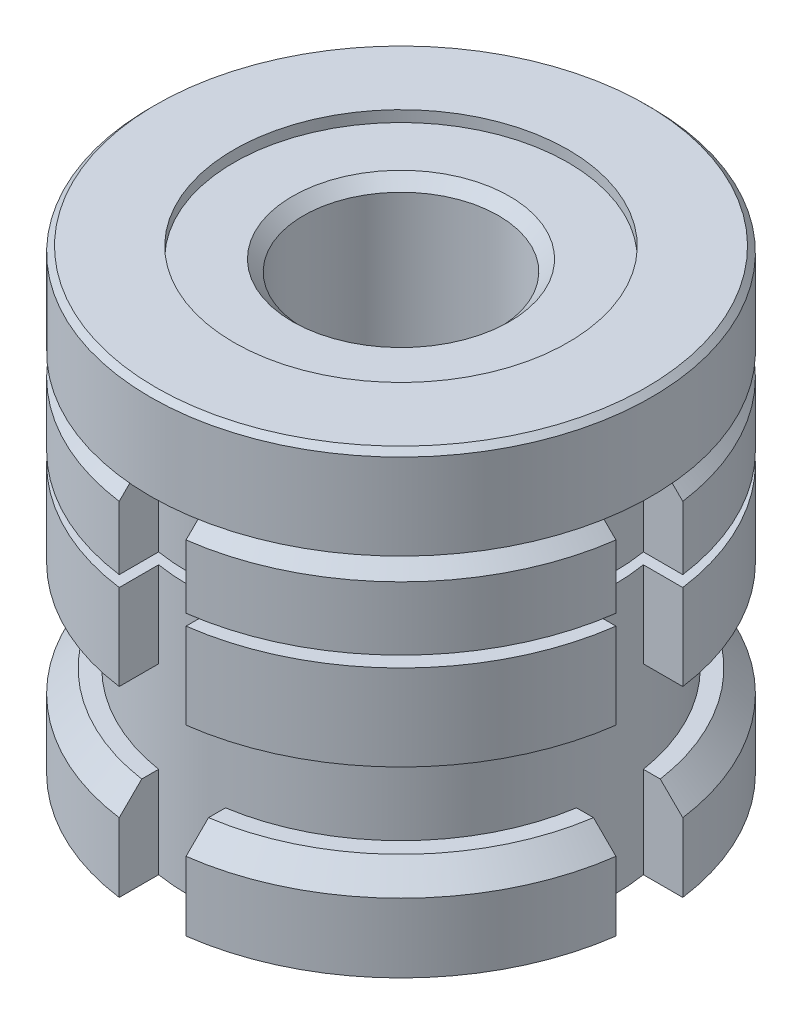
from build123d import *
from build123d.topology import SkipClean

# Parameters (mm, degrees)
SKETCH1_R           = 22.5
BOSS_EXTRUDE1_DEPTH = 16.4
SKETCH2_W           = 7.5
SKETCH2_H           = 1
SKETCH3_R           = 19
BOSS_EXTRUDE2_DEPTH = 16.4
SKETCH4_R           = 22.5
BOSS_EXTRUDE3_DEPTH = 8.2
CUT_EXTRUDE4_START  = -32.8
CUT_EXTRUDE4_DEPTH  = 32.8
CHAMFER1_SIZE       = 2
SKETCH6_R           = 22.5
BOSS_EXTRUDE4_DEPTH = 8.2
CHAMFER2_SIZE       = 0.5
CUT_EXTRUDE5_START  = -1
SKETCH7_R           = 15
CUT_EXTRUDE5_DEPTH  = 1
SKETCH8_R           = 8.75
CUT_EXTRUDE6_DEPTH  = 40
CHAMFER3_SIZE       = 1


with BuildPart() as part:
    # Sketch1 → Boss-Extrude1 (new body)
    with BuildSketch(Plane(origin=(0, 0, 0), x_dir=(1, 0, 0), z_dir=(0, 1, 0))):
        with Locations(Location((0, 0, 0), (0, 0, 270))):
            Circle(SKETCH1_R)
    extrude(amount=BOSS_EXTRUDE1_DEPTH)

    # Sketch2 → Cut-Revolve1 (revolve, cut)
    with BuildSketch(Plane(origin=(0, 0, 0), x_dir=(0, 0, -1), z_dir=(1, 0, 0))):
        with Locations((-18.75, 8.2)):
            Rectangle(SKETCH2_W, SKETCH2_H)
    revolve(axis=Axis((0, 13.26477, 0), (0, -1, 0)), mode=Mode.SUBTRACT)

    # Sketch3 → Boss-Extrude2 (add)
    with BuildSketch(Plane.XZ):
        with Locations(Location((0, 0, 0), (0, 0, 270))):
            Circle(SKETCH3_R)
    extrude(amount=BOSS_EXTRUDE2_DEPTH)

    # Sketch4 → Boss-Extrude3 (add)
    with BuildSketch(Plane.XZ.offset(16.4)):
        with Locations(Location((0, 0, 0), (0, 0, 90))):
            Circle(SKETCH4_R)
    extrude(amount=-BOSS_EXTRUDE3_DEPTH)

    # Sketch5 → Cut-Extrude4 (cut)
    with SkipClean():  # the faces are left unmerged after this step: merging them gives an invalid solid
        with BuildSketch(Plane(origin=(0, 16.4, 0), x_dir=(1, 0, 0), z_dir=(0, 1, 0)).offset(CUT_EXTRUDE4_START)):
            with BuildLine():
                Line((-22.299103, 3), (-18.761663, 3))
                ThreePointArc((-18.761663, 3), (-19, 0), (-18.761663, -3))
                Line((-18.761663, -3), (-22.299103, -3))
                ThreePointArc((-22.299103, -3), (-22.5, 0), (-22.299103, 3))
            make_face()
            with BuildLine():
                Line((-3, 22.299103), (-3, 18.761663))
                ThreePointArc((-3, 18.761663), (0, 19), (3, 18.761663))
                Line((3, 18.761663), (3, 22.299103))
                ThreePointArc((3, 22.299103), (0, 22.5), (-3, 22.299103))
            make_face()
            with BuildLine():
                Line((18.761663, 3), (22.299103, 3))
                ThreePointArc((22.299103, 3), (22.5, 0), (22.299103, -3))
                Line((22.299103, -3), (18.761663, -3))
                ThreePointArc((18.761663, -3), (19, 0), (18.761663, 3))
            make_face()
            with BuildLine():
                Line((-3, -18.761663), (-3, -22.299103))
                ThreePointArc((-3, -22.299103), (0, -22.5), (3, -22.299103))
                Line((3, -22.299103), (3, -18.761663))
                ThreePointArc((3, -18.761663), (0, -19), (-3, -18.761663))
            make_face()
        extrude(amount=CUT_EXTRUDE4_DEPTH, mode=Mode.SUBTRACT)

    # Chamfer1
    chamfer1_edges = [part.edges().sort_by_distance(p)[0] for p in [
        (15.909903, -8.2, -15.909903),
        (15.909903, -8.2, 15.909903),
        (-15.909903, -8.2, 15.909903),
        (-15.909903, -8.2, -15.909903),
        (15.909903, 16.4, 15.909903),
        (15.909903, 16.4, -15.909903),
        (-15.909903, 16.4, -15.909903),
        (-15.909903, 16.4, 15.909903),
    ]]
    chamfer(chamfer1_edges, length=CHAMFER1_SIZE)

    # Sketch6 → Boss-Extrude4 (add)
    with BuildSketch(Plane(origin=(0, 16.4, 0), x_dir=(1, 0, 0), z_dir=(0, 1, 0))):
        with Locations(Location((0, 0, 0), (0, 0, 270))):
            Circle(SKETCH6_R)
    extrude(amount=BOSS_EXTRUDE4_DEPTH)

    # Chamfer2
    chamfer2_edges = [part.edges().sort_by_distance(p)[0] for p in [
        (0, 24.6, -22.5),
    ]]
    chamfer(chamfer2_edges, length=CHAMFER2_SIZE)

    # Sketch7 → Cut-Extrude5 (cut)
    with BuildSketch(Plane(origin=(0, 24.6, 0), x_dir=(1, 0, 0), z_dir=(0, 1, 0)).offset(CUT_EXTRUDE5_START)):
        with Locations(Location((0, 0, 0), (0, 0, 270))):
            Circle(SKETCH7_R)
    extrude(amount=CUT_EXTRUDE5_DEPTH, mode=Mode.SUBTRACT)

    # Sketch8 → Cut-Extrude6 (cut)
    with BuildSketch(Plane(origin=(0, 23.6, 0), x_dir=(1, 0, 0), z_dir=(0, 1, 0))):
        with Locations(Location((0, 0, 0), (0, 0, 270))):
            Circle(SKETCH8_R)
    extrude(amount=-CUT_EXTRUDE6_DEPTH, mode=Mode.SUBTRACT)

    # Chamfer3
    chamfer3_edges = [part.edges().sort_by_distance(p)[0] for p in [
        (0, 23.6, -8.75),
        (0, -16.4, -8.75),
    ]]
    chamfer(chamfer3_edges, length=CHAMFER3_SIZE)


solid = part.part
